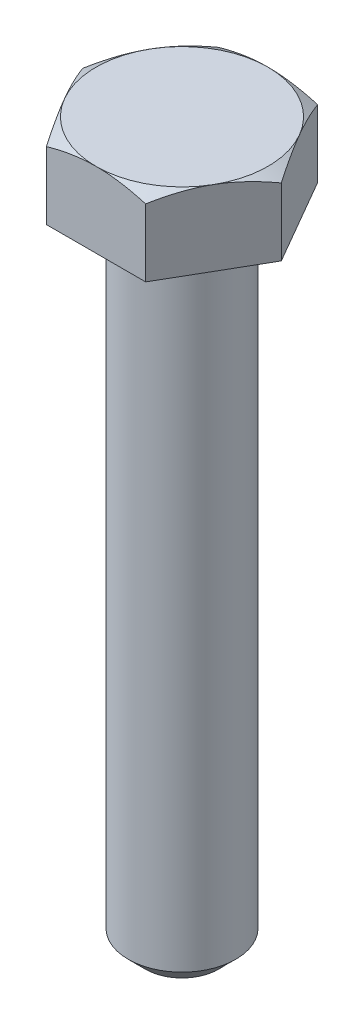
ISO-10303-21;
HEADER;
FILE_DESCRIPTION(('STEP AP214'),'2;1');
FILE_NAME('part.step','',(''),(''),'','','');
FILE_SCHEMA(('AUTOMOTIVE_DESIGN { 1 0 10303 214 1 1 1 1 }'));
ENDSEC;
DATA;
#1=APPLICATION_CONTEXT('core data for automotive mechanical design processes');
#2=APPLICATION_PROTOCOL_DEFINITION('international standard','automotive_design',2000,#1);
#3=PRODUCT_CONTEXT('',#1,'mechanical');
#4=PRODUCT('Part','Part','',(#3));
#5=PRODUCT_RELATED_PRODUCT_CATEGORY('part','',(#4));
#6=PRODUCT_DEFINITION_FORMATION('','',#4);
#7=PRODUCT_DEFINITION_CONTEXT('part definition',#1,'design');
#8=PRODUCT_DEFINITION('design','',#6,#7);
#9=PRODUCT_DEFINITION_SHAPE('','',#8);
#10=(LENGTH_UNIT() NAMED_UNIT(*) SI_UNIT(.MILLI.,.METRE.));
#11=(NAMED_UNIT(*) PLANE_ANGLE_UNIT() SI_UNIT($,.RADIAN.));
#12=(NAMED_UNIT(*) SI_UNIT($,.STERADIAN.) SOLID_ANGLE_UNIT());
#13=UNCERTAINTY_MEASURE_WITH_UNIT(LENGTH_MEASURE(1.E-05),#10,'distance_accuracy_value','');
#14=(GEOMETRIC_REPRESENTATION_CONTEXT(3) GLOBAL_UNCERTAINTY_ASSIGNED_CONTEXT((#13)) GLOBAL_UNIT_ASSIGNED_CONTEXT((#10,
#11,#12)) REPRESENTATION_CONTEXT('',''));
#15=CARTESIAN_POINT('',(0.,0.,0.));
#16=DIRECTION('',(0.,0.,1.));
#17=DIRECTION('',(1.,0.,0.));
#18=AXIS2_PLACEMENT_3D('',#15,#16,#17);
#19=CARTESIAN_POINT('',(0.,3.5,0.));
#20=DIRECTION('',(0.,-1.,0.));
#21=DIRECTION('',(1.,0.,0.));
#22=AXIS2_PLACEMENT_3D('',#19,#20,#21);
#23=PLANE('',#22);
#24=CARTESIAN_POINT('',(0.,3.50000000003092,0.));
#25=DIRECTION('',(0.,-1.,0.));
#26=DIRECTION('',(0.,0.,-1.));
#27=AXIS2_PLACEMENT_3D('',#24,#25,#26);
#28=CIRCLE('',#27,3.99999999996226);
#29=CARTESIAN_POINT('',(3.4641016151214,3.50000000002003,1.99999999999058));
#30=VERTEX_POINT('',#29);
#31=CARTESIAN_POINT('',(0.,3.50000000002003,3.99999999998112));
#32=VERTEX_POINT('',#31);
#33=EDGE_CURVE('E89',#30,#32,#28,.T.);
#34=ORIENTED_EDGE('',*,*,#33,.F.);
#35=CARTESIAN_POINT('',(0.,3.50000000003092,0.));
#36=DIRECTION('',(0.,-1.,0.));
#37=DIRECTION('',(0.,0.,-1.));
#38=AXIS2_PLACEMENT_3D('',#35,#36,#37);
#39=CIRCLE('',#38,3.99999999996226);
#40=CARTESIAN_POINT('',(3.4641016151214,3.50000000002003,-1.99999999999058));
#41=VERTEX_POINT('',#40);
#42=EDGE_CURVE('E87',#41,#30,#39,.T.);
#43=ORIENTED_EDGE('',*,*,#42,.F.);
#44=CARTESIAN_POINT('',(0.,3.50000000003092,0.));
#45=DIRECTION('',(0.,-1.,0.));
#46=DIRECTION('',(0.,0.,-1.));
#47=AXIS2_PLACEMENT_3D('',#44,#45,#46);
#48=CIRCLE('',#47,3.99999999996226);
#49=CARTESIAN_POINT('',(0.,3.50000000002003,-3.99999999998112));
#50=VERTEX_POINT('',#49);
#51=EDGE_CURVE('E20',#50,#41,#48,.T.);
#52=ORIENTED_EDGE('',*,*,#51,.F.);
#53=CARTESIAN_POINT('',(0.,3.50000000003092,0.));
#54=DIRECTION('',(0.,-1.,0.));
#55=DIRECTION('',(0.,0.,-1.));
#56=AXIS2_PLACEMENT_3D('',#53,#54,#55);
#57=CIRCLE('',#56,3.99999999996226);
#58=CARTESIAN_POINT('',(-3.4641016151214,3.50000000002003,-1.99999999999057));
#59=VERTEX_POINT('',#58);
#60=EDGE_CURVE('E104',#59,#50,#57,.T.);
#61=ORIENTED_EDGE('',*,*,#60,.F.);
#62=CARTESIAN_POINT('',(0.,3.50000000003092,0.));
#63=DIRECTION('',(0.,-1.,0.));
#64=DIRECTION('',(0.,0.,-1.));
#65=AXIS2_PLACEMENT_3D('',#62,#63,#64);
#66=CIRCLE('',#65,3.99999999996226);
#67=CARTESIAN_POINT('',(-3.4641016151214,3.50000000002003,1.99999999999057));
#68=VERTEX_POINT('',#67);
#69=EDGE_CURVE('E323',#68,#59,#66,.T.);
#70=ORIENTED_EDGE('',*,*,#69,.F.);
#71=CARTESIAN_POINT('',(0.,3.50000000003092,0.));
#72=DIRECTION('',(0.,-1.,0.));
#73=DIRECTION('',(0.,0.,-1.));
#74=AXIS2_PLACEMENT_3D('',#71,#72,#73);
#75=CIRCLE('',#74,3.99999999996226);
#76=EDGE_CURVE('E93',#32,#68,#75,.T.);
#77=ORIENTED_EDGE('',*,*,#76,.F.);
#78=EDGE_LOOP('',(#34,#43,#52,#61,#70,#77));
#79=FACE_BOUND('',#78,.T.);
#80=ADVANCED_FACE('F16',(#79),#23,.F.);
#81=CARTESIAN_POINT('',(0.,3.14059081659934,0.));
#82=DIRECTION('',(0.,-1.,0.));
#83=DIRECTION('',(0.,0.,-1.));
#84=AXIS2_PLACEMENT_3D('',#81,#82,#83);
#85=CONICAL_SURFACE('',#84,4.62251496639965,1.04719755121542);
#86=ORIENTED_EDGE('',*,*,#51,.T.);
#87=CARTESIAN_POINT('',(2.30940107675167,3.14273441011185,-4.00000000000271));
#88=CARTESIAN_POINT('',(2.4033932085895,3.19701440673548,-3.8372008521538));
#89=CARTESIAN_POINT('',(2.49813806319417,3.24674436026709,-3.67309795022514));
#90=CARTESIAN_POINT('',(2.68846293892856,3.33444223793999,-3.34344559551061));
#91=CARTESIAN_POINT('',(2.78403632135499,3.37246832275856,-3.17790764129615));
#92=CARTESIAN_POINT('',(2.92829837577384,3.41915789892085,-2.9280384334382));
#93=CARTESIAN_POINT('',(2.97656796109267,3.43300183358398,-2.84443305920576));
#94=CARTESIAN_POINT('',(3.07333821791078,3.45696597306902,-2.67682205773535));
#95=CARTESIAN_POINT('',(3.12183888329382,3.46708627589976,-2.59281644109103));
#96=CARTESIAN_POINT('',(3.21925069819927,3.48342533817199,-2.42409422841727));
#97=CARTESIAN_POINT('',(3.26816268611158,3.4896242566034,-2.33937618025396));
#98=CARTESIAN_POINT('',(3.36608285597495,3.49792016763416,-2.16977347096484));
#99=CARTESIAN_POINT('',(3.41509105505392,3.50001634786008,-2.08488878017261));
#100=CARTESIAN_POINT('',(3.46410161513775,3.50000000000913,-2.00000000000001));
#101=B_SPLINE_CURVE_WITH_KNOTS('',3,(#87,#88,#89,#90,#91,#92,#93,#94,#95,#96,#97,#98,#99,#100),
.UNSPECIFIED.,.F.,.F.,(4,2,2,2,2,2,4),(0.,0.587229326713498,1.17149154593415,1.4640059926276,
1.75651273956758,2.05048788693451,2.3445212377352),.UNSPECIFIED.);
#102=CARTESIAN_POINT('',(2.30940107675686,3.14273441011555,-4.00000000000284));
#103=VERTEX_POINT('',#102);
#104=EDGE_CURVE('E99',#103,#41,#101,.T.);
#105=ORIENTED_EDGE('',*,*,#104,.F.);
#106=CARTESIAN_POINT('',(0.,3.50000000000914,-3.99999999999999));
#107=CARTESIAN_POINT('',(0.0980211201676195,3.50001634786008,-3.99999999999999));
#108=CARTESIAN_POINT('',(0.196037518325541,3.49792016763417,-3.99999999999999));
#109=CARTESIAN_POINT('',(0.39187785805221,3.48962425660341,-3.99999999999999));
#110=CARTESIAN_POINT('',(0.489701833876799,3.48342533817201,-3.99999999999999));
#111=CARTESIAN_POINT('',(0.684525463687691,3.46708627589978,-3.99999999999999));
#112=CARTESIAN_POINT('',(0.781526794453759,3.45696597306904,-3.99999999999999));
#113=CARTESIAN_POINT('',(0.975067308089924,3.43300183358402,-3.99999999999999));
#114=CARTESIAN_POINT('',(1.07160647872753,3.41915789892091,-3.99999999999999));
#115=CARTESIAN_POINT('',(1.36013058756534,3.37246832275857,-3.99999999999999));
#116=CARTESIAN_POINT('',(1.55127735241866,3.33444223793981,-3.99999999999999));
#117=CARTESIAN_POINT('',(1.93192710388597,3.24674436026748,-3.99999999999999));
#118=CARTESIAN_POINT('',(2.12141681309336,3.19701440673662,-3.99999999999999));
#119=CARTESIAN_POINT('',(2.30940107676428,3.14273441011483,-3.99999999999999));
#120=B_SPLINE_CURVE_WITH_KNOTS('',3,(#106,#107,#108,#109,#110,#111,#112,#113,#114,#115,#116,
#117,#118,#119),.UNSPECIFIED.,.F.,.F.,(4,2,2,2,2,2,4),(0.,0.294033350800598,0.588008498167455,
0.880515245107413,1.17302969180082,1.75729191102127,2.34452123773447),.UNSPECIFIED.);
#121=EDGE_CURVE('E102',#50,#103,#120,.T.);
#122=ORIENTED_EDGE('',*,*,#121,.F.);
#123=EDGE_LOOP('',(#86,#105,#122));
#124=FACE_BOUND('',#123,.T.);
#125=ADVANCED_FACE('F97',(#124),#85,.T.);
#126=CARTESIAN_POINT('',(0.,3.14059081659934,0.));
#127=DIRECTION('',(0.,-1.,0.));
#128=DIRECTION('',(0.,0.,-1.));
#129=AXIS2_PLACEMENT_3D('',#126,#127,#128);
#130=CONICAL_SURFACE('',#129,4.62251496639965,1.04719755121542);
#131=ORIENTED_EDGE('',*,*,#60,.T.);
#132=CARTESIAN_POINT('',(-2.30940107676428,3.14273441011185,-3.99999999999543));
#133=CARTESIAN_POINT('',(-2.12141681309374,3.19701440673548,-3.9999999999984));
#134=CARTESIAN_POINT('',(-1.93192710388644,3.24674436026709,-3.99999999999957));
#135=CARTESIAN_POINT('',(-1.55127735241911,3.33444223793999,-4.0000000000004));
#136=CARTESIAN_POINT('',(-1.36013058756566,3.37246832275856,-4.00000000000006));
#137=CARTESIAN_POINT('',(-1.07160647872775,3.41915789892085,-3.99999999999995));
#138=CARTESIAN_POINT('',(-0.975067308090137,3.43300183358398,-3.99999999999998));
#139=CARTESIAN_POINT('',(-0.781526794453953,3.45696597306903,-4.));
#140=CARTESIAN_POINT('',(-0.684525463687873,3.46708627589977,-3.99999999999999));
#141=CARTESIAN_POINT('',(-0.489701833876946,3.483425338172,-3.99999999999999));
#142=CARTESIAN_POINT('',(-0.391877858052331,3.4896242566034,-3.99999999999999));
#143=CARTESIAN_POINT('',(-0.196037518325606,3.49792016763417,-3.99999999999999));
#144=CARTESIAN_POINT('',(-0.098021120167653,3.50001634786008,-3.99999999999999));
#145=CARTESIAN_POINT('',(0.,3.50000000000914,-3.99999999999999));
#146=B_SPLINE_CURVE_WITH_KNOTS('',3,(#132,#133,#134,#135,#136,#137,#138,#139,#140,#141,#142,
#143,#144,#145),.UNSPECIFIED.,.F.,.F.,(4,2,2,2,2,2,4),(0.,0.587229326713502,1.17149154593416,
1.46400599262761,1.75651273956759,2.05048788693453,2.34452123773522),.UNSPECIFIED.);
#147=CARTESIAN_POINT('',(-2.30940107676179,3.14273441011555,-3.99999999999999));
#148=VERTEX_POINT('',#147);
#149=EDGE_CURVE('E113',#148,#50,#146,.T.);
#150=ORIENTED_EDGE('',*,*,#149,.F.);
#151=CARTESIAN_POINT('',(-3.46410161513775,3.50000000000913,-2.00000000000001));
#152=CARTESIAN_POINT('',(-3.41509105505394,3.50001634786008,-2.08488878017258));
#153=CARTESIAN_POINT('',(-3.36608285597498,3.49792016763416,-2.16977347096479));
#154=CARTESIAN_POINT('',(-3.26816268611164,3.4896242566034,-2.33937618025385));
#155=CARTESIAN_POINT('',(-3.21925069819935,3.483425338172,-2.42409422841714));
#156=CARTESIAN_POINT('',(-3.1218388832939,3.46708627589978,-2.59281644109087));
#157=CARTESIAN_POINT('',(-3.07333821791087,3.45696597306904,-2.67682205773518));
#158=CARTESIAN_POINT('',(-2.97656796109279,3.43300183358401,-2.84443305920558));
#159=CARTESIAN_POINT('',(-2.92829837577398,3.41915789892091,-2.92803843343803));
#160=CARTESIAN_POINT('',(-2.78403632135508,3.37246832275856,-3.17790764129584));
#161=CARTESIAN_POINT('',(-2.68846293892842,3.33444223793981,-3.34344559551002));
#162=CARTESIAN_POINT('',(-2.49813806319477,3.24674436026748,-3.67309795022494));
#163=CARTESIAN_POINT('',(-2.40339320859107,3.19701440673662,-3.83720085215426));
#164=CARTESIAN_POINT('',(-2.30940107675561,3.14273441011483,-4.00000000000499));
#165=B_SPLINE_CURVE_WITH_KNOTS('',3,(#151,#152,#153,#154,#155,#156,#157,#158,#159,#160,#161,
#162,#163,#164),.UNSPECIFIED.,.F.,.F.,(4,2,2,2,2,2,4),(0.,0.294033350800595,0.58800849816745,
0.880515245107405,1.17302969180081,1.75729191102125,2.34452123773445),.UNSPECIFIED.);
#166=EDGE_CURVE('E169',#59,#148,#165,.T.);
#167=ORIENTED_EDGE('',*,*,#166,.F.);
#168=EDGE_LOOP('',(#131,#150,#167));
#169=FACE_BOUND('',#168,.T.);
#170=ADVANCED_FACE('F137',(#169),#130,.T.);
#171=CARTESIAN_POINT('',(0.,3.14059081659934,0.));
#172=DIRECTION('',(0.,-1.,0.));
#173=DIRECTION('',(0.,0.,-1.));
#174=AXIS2_PLACEMENT_3D('',#171,#172,#173);
#175=CONICAL_SURFACE('',#174,4.62251496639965,1.04719755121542);
#176=ORIENTED_EDGE('',*,*,#69,.T.);
#177=CARTESIAN_POINT('',(-4.61880215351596,3.14273441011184,7.2818296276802E-12));
#178=CARTESIAN_POINT('',(-4.52481002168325,3.19701440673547,-0.162799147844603));
#179=CARTESIAN_POINT('',(-4.43006516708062,3.24674436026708,-0.326902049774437));
#180=CARTESIAN_POINT('',(-4.23974029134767,3.33444223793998,-0.656554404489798));
#181=CARTESIAN_POINT('',(-4.14416690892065,3.37246832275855,-0.822092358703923));
#182=CARTESIAN_POINT('',(-3.9999048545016,3.41915789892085,-1.07196156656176));
#183=CARTESIAN_POINT('',(-3.95163526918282,3.43300183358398,-1.15556694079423));
#184=CARTESIAN_POINT('',(-3.85486501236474,3.45696597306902,-1.32317794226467));
#185=CARTESIAN_POINT('',(-3.80636434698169,3.46708627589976,-1.40718355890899));
#186=CARTESIAN_POINT('',(-3.70895253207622,3.48342533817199,-1.57590577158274));
#187=CARTESIAN_POINT('',(-3.66004054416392,3.4896242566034,-1.66062381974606));
#188=CARTESIAN_POINT('',(-3.56212037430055,3.49792016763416,-1.83022652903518));
#189=CARTESIAN_POINT('',(-3.51311217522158,3.50001634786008,-1.91511121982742));
#190=CARTESIAN_POINT('',(-3.46410161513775,3.50000000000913,-2.00000000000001));
#191=B_SPLINE_CURVE_WITH_KNOTS('',3,(#177,#178,#179,#180,#181,#182,#183,#184,#185,#186,#187,
#188,#189,#190),.UNSPECIFIED.,.F.,.F.,(4,2,2,2,2,2,4),(0.,0.587229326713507,1.17149154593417,
1.46400599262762,1.75651273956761,2.05048788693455,2.34452123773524),.UNSPECIFIED.);
#192=CARTESIAN_POINT('',(-4.61880215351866,3.14273441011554,2.84537209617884E-12));
#193=VERTEX_POINT('',#192);
#194=EDGE_CURVE('E146',#193,#59,#191,.T.);
#195=ORIENTED_EDGE('',*,*,#194,.F.);
#196=CARTESIAN_POINT('',(-3.46410161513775,3.50000000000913,2.00000000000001));
#197=CARTESIAN_POINT('',(-3.51311217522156,3.50001634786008,1.91511121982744));
#198=CARTESIAN_POINT('',(-3.56212037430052,3.49792016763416,1.83022652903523));
#199=CARTESIAN_POINT('',(-3.66004054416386,3.4896242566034,1.66062381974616));
#200=CARTESIAN_POINT('',(-3.70895253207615,3.483425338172,1.57590577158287));
#201=CARTESIAN_POINT('',(-3.8063643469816,3.46708627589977,1.40718355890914));
#202=CARTESIAN_POINT('',(-3.85486501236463,3.45696597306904,1.32317794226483));
#203=CARTESIAN_POINT('',(-3.95163526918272,3.43300183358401,1.15556694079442));
#204=CARTESIAN_POINT('',(-3.99990485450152,3.4191578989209,1.07196156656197));
#205=CARTESIAN_POINT('',(-4.14416690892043,3.37246832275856,0.822092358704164));
#206=CARTESIAN_POINT('',(-4.23974029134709,3.3344422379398,0.656554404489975));
#207=CARTESIAN_POINT('',(-4.43006516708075,3.24674436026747,0.326902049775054));
#208=CARTESIAN_POINT('',(-4.52481002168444,3.19701440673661,0.162799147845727));
#209=CARTESIAN_POINT('',(-4.6188021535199,3.14273441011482,-5.00231021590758E-12));
#210=B_SPLINE_CURVE_WITH_KNOTS('',3,(#196,#197,#198,#199,#200,#201,#202,#203,#204,#205,#206,
#207,#208,#209),.UNSPECIFIED.,.F.,.F.,(4,2,2,2,2,2,4),(0.,0.294033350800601,0.58800849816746,
0.880515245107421,1.17302969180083,1.75729191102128,2.34452123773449),.UNSPECIFIED.);
#211=EDGE_CURVE('E183',#68,#193,#210,.T.);
#212=ORIENTED_EDGE('',*,*,#211,.F.);
#213=EDGE_LOOP('',(#176,#195,#212));
#214=FACE_BOUND('',#213,.T.);
#215=ADVANCED_FACE('F191',(#214),#175,.T.);
#216=CARTESIAN_POINT('',(0.,3.14059081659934,0.));
#217=DIRECTION('',(0.,-1.,0.));
#218=DIRECTION('',(0.,0.,-1.));
#219=AXIS2_PLACEMENT_3D('',#216,#217,#218);
#220=CONICAL_SURFACE('',#219,4.62251496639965,1.04719755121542);
#221=ORIENTED_EDGE('',*,*,#76,.T.);
#222=CARTESIAN_POINT('',(-2.30940107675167,3.14273441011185,4.00000000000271));
#223=CARTESIAN_POINT('',(-2.40339320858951,3.19701440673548,3.8372008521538));
#224=CARTESIAN_POINT('',(-2.49813806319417,3.24674436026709,3.67309795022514));
#225=CARTESIAN_POINT('',(-2.68846293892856,3.33444223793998,3.34344559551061));
#226=CARTESIAN_POINT('',(-2.78403632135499,3.37246832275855,3.17790764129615));
#227=CARTESIAN_POINT('',(-2.92829837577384,3.41915789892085,2.9280384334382));
#228=CARTESIAN_POINT('',(-2.97656796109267,3.43300183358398,2.84443305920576));
#229=CARTESIAN_POINT('',(-3.07333821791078,3.45696597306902,2.67682205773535));
#230=CARTESIAN_POINT('',(-3.12183888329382,3.46708627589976,2.59281644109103));
#231=CARTESIAN_POINT('',(-3.21925069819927,3.48342533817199,2.42409422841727));
#232=CARTESIAN_POINT('',(-3.26816268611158,3.4896242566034,2.33937618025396));
#233=CARTESIAN_POINT('',(-3.36608285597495,3.49792016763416,2.16977347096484));
#234=CARTESIAN_POINT('',(-3.41509105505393,3.50001634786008,2.08488878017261));
#235=CARTESIAN_POINT('',(-3.46410161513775,3.50000000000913,2.00000000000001));
#236=B_SPLINE_CURVE_WITH_KNOTS('',3,(#222,#223,#224,#225,#226,#227,#228,#229,#230,#231,#232,
#233,#234,#235),.UNSPECIFIED.,.F.,.F.,(4,2,2,2,2,2,4),(0.,0.587229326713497,1.17149154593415,
1.4640059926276,1.75651273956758,2.05048788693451,2.3445212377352),.UNSPECIFIED.);
#237=CARTESIAN_POINT('',(-2.30940107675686,3.14273441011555,4.00000000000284));
#238=VERTEX_POINT('',#237);
#239=EDGE_CURVE('E176',#238,#68,#236,.T.);
#240=ORIENTED_EDGE('',*,*,#239,.F.);
#241=CARTESIAN_POINT('',(0.,3.50000000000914,3.99999999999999));
#242=CARTESIAN_POINT('',(-0.0980211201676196,3.50001634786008,3.99999999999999));
#243=CARTESIAN_POINT('',(-0.196037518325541,3.49792016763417,3.99999999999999));
#244=CARTESIAN_POINT('',(-0.39187785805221,3.48962425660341,3.99999999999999));
#245=CARTESIAN_POINT('',(-0.489701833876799,3.48342533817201,3.99999999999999));
#246=CARTESIAN_POINT('',(-0.684525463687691,3.46708627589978,3.99999999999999));
#247=CARTESIAN_POINT('',(-0.78152679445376,3.45696597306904,3.99999999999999));
#248=CARTESIAN_POINT('',(-0.975067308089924,3.43300183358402,3.99999999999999));
#249=CARTESIAN_POINT('',(-1.07160647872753,3.41915789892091,3.99999999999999));
#250=CARTESIAN_POINT('',(-1.36013058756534,3.37246832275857,3.99999999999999));
#251=CARTESIAN_POINT('',(-1.55127735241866,3.33444223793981,3.99999999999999));
#252=CARTESIAN_POINT('',(-1.93192710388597,3.24674436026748,3.99999999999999));
#253=CARTESIAN_POINT('',(-2.12141681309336,3.19701440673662,3.99999999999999));
#254=CARTESIAN_POINT('',(-2.30940107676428,3.14273441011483,3.99999999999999));
#255=B_SPLINE_CURVE_WITH_KNOTS('',3,(#241,#242,#243,#244,#245,#246,#247,#248,#249,#250,#251,
#252,#253,#254),.UNSPECIFIED.,.F.,.F.,(4,2,2,2,2,2,4),(0.,0.294033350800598,0.588008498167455,
0.880515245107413,1.17302969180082,1.75729191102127,2.34452123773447),.UNSPECIFIED.);
#256=EDGE_CURVE('E198',#32,#238,#255,.T.);
#257=ORIENTED_EDGE('',*,*,#256,.F.);
#258=EDGE_LOOP('',(#221,#240,#257));
#259=FACE_BOUND('',#258,.T.);
#260=ADVANCED_FACE('F188',(#259),#220,.T.);
#261=CARTESIAN_POINT('',(0.,3.14059081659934,0.));
#262=DIRECTION('',(0.,-1.,0.));
#263=DIRECTION('',(0.,0.,-1.));
#264=AXIS2_PLACEMENT_3D('',#261,#262,#263);
#265=CONICAL_SURFACE('',#264,4.62251496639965,1.04719755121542);
#266=ORIENTED_EDGE('',*,*,#42,.T.);
#267=CARTESIAN_POINT('',(4.61880215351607,3.1427344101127,-5.88236889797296E-12));
#268=CARTESIAN_POINT('',(4.52481002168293,3.19701440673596,0.16279914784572));
#269=CARTESIAN_POINT('',(4.43006516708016,3.24674436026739,0.326902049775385));
#270=CARTESIAN_POINT('',(4.23974029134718,3.33444223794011,0.656554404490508));
#271=CARTESIAN_POINT('',(4.14416690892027,3.37246832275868,0.822092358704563));
#272=CARTESIAN_POINT('',(3.99990485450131,3.41915789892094,1.07196156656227));
#273=CARTESIAN_POINT('',(3.95163526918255,3.43300183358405,1.1555669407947));
#274=CARTESIAN_POINT('',(3.85486501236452,3.45696597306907,1.32317794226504));
#275=CARTESIAN_POINT('',(3.8063643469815,3.4670862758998,1.40718355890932));
#276=CARTESIAN_POINT('',(3.70895253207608,3.48342533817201,1.57590577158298));
#277=CARTESIAN_POINT('',(3.6600405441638,3.48962425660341,1.66062381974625));
#278=CARTESIAN_POINT('',(3.5621203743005,3.49792016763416,1.83022652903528));
#279=CARTESIAN_POINT('',(3.51311217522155,3.50001634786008,1.91511121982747));
#280=CARTESIAN_POINT('',(3.46410161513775,3.50000000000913,2.00000000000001));
#281=B_SPLINE_CURVE_WITH_KNOTS('',3,(#267,#268,#269,#270,#271,#272,#273,#274,#275,#276,#277,
#278,#279,#280),.UNSPECIFIED.,.F.,.F.,(4,2,2,2,2,2,4),(0.,0.587229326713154,1.17149154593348,
1.46400599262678,1.75651273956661,2.05048788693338,2.34452123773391),.UNSPECIFIED.);
#282=CARTESIAN_POINT('',(4.61880215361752,3.14273441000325,2.28554564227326E-12));
#283=VERTEX_POINT('',#282);
#284=EDGE_CURVE('E109',#283,#30,#281,.T.);
#285=ORIENTED_EDGE('',*,*,#284,.F.);
#286=CARTESIAN_POINT('',(3.46410161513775,3.50000000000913,-2.00000000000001));
#287=CARTESIAN_POINT('',(3.51311217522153,3.50001634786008,-1.91511121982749));
#288=CARTESIAN_POINT('',(3.56212037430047,3.49792016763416,-1.83022652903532));
#289=CARTESIAN_POINT('',(3.66004054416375,3.48962425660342,-1.66062381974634));
#290=CARTESIAN_POINT('',(3.70895253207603,3.48342533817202,-1.57590577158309));
#291=CARTESIAN_POINT('',(3.80636434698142,3.46708627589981,-1.40718355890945));
#292=CARTESIAN_POINT('',(3.85486501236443,3.45696597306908,-1.32317794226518));
#293=CARTESIAN_POINT('',(3.95163526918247,3.43300183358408,-1.15556694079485));
#294=CARTESIAN_POINT('',(3.99990485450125,3.41915789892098,-1.07196156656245));
#295=CARTESIAN_POINT('',(4.14416690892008,3.37246832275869,-0.82209235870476));
#296=CARTESIAN_POINT('',(4.2397402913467,3.33444223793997,-0.656554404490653));
#297=CARTESIAN_POINT('',(4.43006516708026,3.24674436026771,-0.326902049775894));
#298=CARTESIAN_POINT('',(4.52481002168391,3.1970144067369,-0.162799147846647));
#299=CARTESIAN_POINT('',(4.61880215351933,3.14273441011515,4.0037334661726E-12));
#300=B_SPLINE_CURVE_WITH_KNOTS('',3,(#286,#287,#288,#289,#290,#291,#292,#293,#294,#295,#296,
#297,#298,#299),.UNSPECIFIED.,.F.,.F.,(4,2,2,2,2,2,4),(0.,0.294033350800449,0.588008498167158,
0.880515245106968,1.17302969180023,1.75729191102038,2.34452123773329),.UNSPECIFIED.);
#301=EDGE_CURVE('E106',#41,#283,#300,.T.);
#302=ORIENTED_EDGE('',*,*,#301,.F.);
#303=EDGE_LOOP('',(#266,#285,#302));
#304=FACE_BOUND('',#303,.T.);
#305=ADVANCED_FACE('F107',(#304),#265,.T.);
#306=CARTESIAN_POINT('',(0.,3.14059081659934,0.));
#307=DIRECTION('',(0.,-1.,0.));
#308=DIRECTION('',(0.,0.,-1.));
#309=AXIS2_PLACEMENT_3D('',#306,#307,#308);
#310=CONICAL_SURFACE('',#309,4.62251496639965,1.04719755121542);
#311=ORIENTED_EDGE('',*,*,#33,.T.);
#312=CARTESIAN_POINT('',(2.30940107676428,3.14273441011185,3.99999999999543));
#313=CARTESIAN_POINT('',(2.12141681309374,3.19701440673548,3.9999999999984));
#314=CARTESIAN_POINT('',(1.93192710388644,3.24674436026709,3.99999999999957));
#315=CARTESIAN_POINT('',(1.5512773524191,3.33444223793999,4.0000000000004));
#316=CARTESIAN_POINT('',(1.36013058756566,3.37246832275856,4.00000000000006));
#317=CARTESIAN_POINT('',(1.07160647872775,3.41915789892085,3.99999999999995));
#318=CARTESIAN_POINT('',(0.975067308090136,3.43300183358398,3.99999999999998));
#319=CARTESIAN_POINT('',(0.781526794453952,3.45696597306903,4.));
#320=CARTESIAN_POINT('',(0.684525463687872,3.46708627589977,3.99999999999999));
#321=CARTESIAN_POINT('',(0.489701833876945,3.483425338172,3.99999999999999));
#322=CARTESIAN_POINT('',(0.39187785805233,3.4896242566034,3.99999999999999));
#323=CARTESIAN_POINT('',(0.196037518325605,3.49792016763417,3.99999999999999));
#324=CARTESIAN_POINT('',(0.0980211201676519,3.50001634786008,3.99999999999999));
#325=CARTESIAN_POINT('',(0.,3.50000000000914,3.99999999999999));
#326=B_SPLINE_CURVE_WITH_KNOTS('',3,(#312,#313,#314,#315,#316,#317,#318,#319,#320,#321,#322,
#323,#324,#325),.UNSPECIFIED.,.F.,.F.,(4,2,2,2,2,2,4),(0.,0.587229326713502,1.17149154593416,
1.46400599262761,1.7565127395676,2.05048788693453,2.34452123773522),.UNSPECIFIED.);
#327=CARTESIAN_POINT('',(2.30940107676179,3.14273441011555,3.99999999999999));
#328=VERTEX_POINT('',#327);
#329=EDGE_CURVE('E205',#328,#32,#326,.T.);
#330=ORIENTED_EDGE('',*,*,#329,.F.);
#331=CARTESIAN_POINT('',(3.46410161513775,3.50000000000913,2.00000000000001));
#332=CARTESIAN_POINT('',(3.41509105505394,3.50001634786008,2.08488878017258));
#333=CARTESIAN_POINT('',(3.36608285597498,3.49792016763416,2.16977347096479));
#334=CARTESIAN_POINT('',(3.26816268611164,3.4896242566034,2.33937618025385));
#335=CARTESIAN_POINT('',(3.21925069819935,3.483425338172,2.42409422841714));
#336=CARTESIAN_POINT('',(3.1218388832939,3.46708627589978,2.59281644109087));
#337=CARTESIAN_POINT('',(3.07333821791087,3.45696597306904,2.67682205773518));
#338=CARTESIAN_POINT('',(2.97656796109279,3.43300183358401,2.84443305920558));
#339=CARTESIAN_POINT('',(2.92829837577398,3.41915789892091,2.92803843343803));
#340=CARTESIAN_POINT('',(2.78403632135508,3.37246832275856,3.17790764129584));
#341=CARTESIAN_POINT('',(2.68846293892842,3.33444223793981,3.34344559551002));
#342=CARTESIAN_POINT('',(2.49813806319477,3.24674436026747,3.67309795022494));
#343=CARTESIAN_POINT('',(2.40339320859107,3.19701440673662,3.83720085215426));
#344=CARTESIAN_POINT('',(2.30940107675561,3.14273441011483,4.00000000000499));
#345=B_SPLINE_CURVE_WITH_KNOTS('',3,(#331,#332,#333,#334,#335,#336,#337,#338,#339,#340,#341,
#342,#343,#344),.UNSPECIFIED.,.F.,.F.,(4,2,2,2,2,2,4),(0.,0.294033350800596,0.58800849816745,
0.880515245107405,1.17302969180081,1.75729191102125,2.34452123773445),.UNSPECIFIED.);
#346=EDGE_CURVE('E225',#30,#328,#345,.T.);
#347=ORIENTED_EDGE('',*,*,#346,.F.);
#348=EDGE_LOOP('',(#311,#330,#347));
#349=FACE_BOUND('',#348,.T.);
#350=ADVANCED_FACE('F233',(#349),#310,.T.);
#351=CARTESIAN_POINT('',(0.,-30.,0.));
#352=DIRECTION('',(0.,1.,0.));
#353=DIRECTION('',(0.,0.,1.));
#354=AXIS2_PLACEMENT_3D('',#351,#352,#353);
#355=PLANE('',#354);
#356=CARTESIAN_POINT('',(0.,-30.0000000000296,0.));
#357=DIRECTION('',(0.,1.,0.));
#358=DIRECTION('',(0.,0.,1.));
#359=AXIS2_PLACEMENT_3D('',#356,#357,#358);
#360=CIRCLE('',#359,1.70000000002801);
#361=CARTESIAN_POINT('',(0.,-30.0000000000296,1.70000000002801));
#362=VERTEX_POINT('',#361);
#363=EDGE_CURVE('E232',#362,#362,#360,.T.);
#364=ORIENTED_EDGE('',*,*,#363,.F.);
#365=EDGE_LOOP('',(#364));
#366=FACE_BOUND('',#365,.T.);
#367=ADVANCED_FACE('F236',(#366),#355,.F.);
#368=CARTESIAN_POINT('',(2.3094010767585,19.66,-3.99999999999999));
#369=DIRECTION('',(0.866025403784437,0.,-0.500000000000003));
#370=DIRECTION('',(-0.500000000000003,0.,-0.866025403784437));
#371=AXIS2_PLACEMENT_3D('',#368,#369,#370);
#372=PLANE('',#371);
#373=DIRECTION('',(-0.500000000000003,0.,-0.866025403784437));
#374=VECTOR('',#373,1.);
#375=CARTESIAN_POINT('',(4.61880215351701,0.,0.));
#376=LINE('',#375,#374);
#377=CARTESIAN_POINT('',(4.61880215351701,0.,0.));
#378=VERTEX_POINT('',#377);
#379=CARTESIAN_POINT('',(2.3094010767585,0.,-3.99999999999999));
#380=VERTEX_POINT('',#379);
#381=EDGE_CURVE('E268',#378,#380,#376,.T.);
#382=ORIENTED_EDGE('',*,*,#381,.T.);
#383=DIRECTION('',(0.,1.,0.));
#384=VECTOR('',#383,1.);
#385=CARTESIAN_POINT('',(2.3094010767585,19.66,-3.99999999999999));
#386=LINE('',#385,#384);
#387=EDGE_CURVE('E117',#103,#380,#386,.F.);
#388=ORIENTED_EDGE('',*,*,#387,.F.);
#389=ORIENTED_EDGE('',*,*,#104,.T.);
#390=ORIENTED_EDGE('',*,*,#301,.T.);
#391=DIRECTION('',(0.,1.,0.));
#392=VECTOR('',#391,1.);
#393=CARTESIAN_POINT('',(4.61880215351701,19.66,0.));
#394=LINE('',#393,#392);
#395=EDGE_CURVE('E312',#378,#283,#394,.T.);
#396=ORIENTED_EDGE('',*,*,#395,.F.);
#397=EDGE_LOOP('',(#382,#388,#389,#390,#396));
#398=FACE_BOUND('',#397,.T.);
#399=ADVANCED_FACE('F115',(#398),#372,.T.);
#400=CARTESIAN_POINT('',(-2.3094010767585,19.66,-3.99999999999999));
#401=DIRECTION('',(0.,0.,-1.));
#402=DIRECTION('',(-1.,0.,0.));
#403=AXIS2_PLACEMENT_3D('',#400,#401,#402);
#404=PLANE('',#403);
#405=DIRECTION('',(-1.,0.,0.));
#406=VECTOR('',#405,1.);
#407=CARTESIAN_POINT('',(0.,0.,-3.99999999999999));
#408=LINE('',#407,#406);
#409=CARTESIAN_POINT('',(-2.3094010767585,0.,-3.99999999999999));
#410=VERTEX_POINT('',#409);
#411=EDGE_CURVE('E270',#380,#410,#408,.T.);
#412=ORIENTED_EDGE('',*,*,#411,.T.);
#413=DIRECTION('',(0.,1.,0.));
#414=VECTOR('',#413,1.);
#415=CARTESIAN_POINT('',(-2.3094010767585,19.66,-3.99999999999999));
#416=LINE('',#415,#414);
#417=EDGE_CURVE('E175',#148,#410,#416,.F.);
#418=ORIENTED_EDGE('',*,*,#417,.F.);
#419=ORIENTED_EDGE('',*,*,#149,.T.);
#420=ORIENTED_EDGE('',*,*,#121,.T.);
#421=ORIENTED_EDGE('',*,*,#387,.T.);
#422=EDGE_LOOP('',(#412,#418,#419,#420,#421));
#423=FACE_BOUND('',#422,.T.);
#424=ADVANCED_FACE('F155',(#423),#404,.T.);
#425=CARTESIAN_POINT('',(-2.3094010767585,19.66,-3.99999999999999));
#426=DIRECTION('',(-0.866025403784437,0.,-0.500000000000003));
#427=DIRECTION('',(-0.500000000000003,0.,0.866025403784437));
#428=AXIS2_PLACEMENT_3D('',#425,#426,#427);
#429=PLANE('',#428);
#430=DIRECTION('',(-0.500000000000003,0.,0.866025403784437));
#431=VECTOR('',#430,1.);
#432=CARTESIAN_POINT('',(-2.3094010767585,0.,-3.99999999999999));
#433=LINE('',#432,#431);
#434=CARTESIAN_POINT('',(-4.61880215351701,0.,0.));
#435=VERTEX_POINT('',#434);
#436=EDGE_CURVE('E278',#410,#435,#433,.T.);
#437=ORIENTED_EDGE('',*,*,#436,.T.);
#438=DIRECTION('',(0.,1.,0.));
#439=VECTOR('',#438,1.);
#440=CARTESIAN_POINT('',(-4.61880215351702,19.66,0.));
#441=LINE('',#440,#439);
#442=EDGE_CURVE('E302',#193,#435,#441,.F.);
#443=ORIENTED_EDGE('',*,*,#442,.F.);
#444=ORIENTED_EDGE('',*,*,#194,.T.);
#445=ORIENTED_EDGE('',*,*,#166,.T.);
#446=ORIENTED_EDGE('',*,*,#417,.T.);
#447=EDGE_LOOP('',(#437,#443,#444,#445,#446));
#448=FACE_BOUND('',#447,.T.);
#449=ADVANCED_FACE('F158',(#448),#429,.T.);
#450=CARTESIAN_POINT('',(-2.3094010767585,19.66,3.99999999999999));
#451=DIRECTION('',(-0.866025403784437,0.,0.500000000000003));
#452=DIRECTION('',(0.500000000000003,0.,0.866025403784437));
#453=AXIS2_PLACEMENT_3D('',#450,#451,#452);
#454=PLANE('',#453);
#455=DIRECTION('',(0.500000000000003,0.,0.866025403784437));
#456=VECTOR('',#455,1.);
#457=CARTESIAN_POINT('',(-4.61880215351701,0.,0.));
#458=LINE('',#457,#456);
#459=CARTESIAN_POINT('',(-2.3094010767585,0.,3.99999999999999));
#460=VERTEX_POINT('',#459);
#461=EDGE_CURVE('E274',#435,#460,#458,.T.);
#462=ORIENTED_EDGE('',*,*,#461,.T.);
#463=DIRECTION('',(0.,1.,0.));
#464=VECTOR('',#463,1.);
#465=CARTESIAN_POINT('',(-2.3094010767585,19.66,3.99999999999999));
#466=LINE('',#465,#464);
#467=EDGE_CURVE('E204',#238,#460,#466,.F.);
#468=ORIENTED_EDGE('',*,*,#467,.F.);
#469=ORIENTED_EDGE('',*,*,#239,.T.);
#470=ORIENTED_EDGE('',*,*,#211,.T.);
#471=ORIENTED_EDGE('',*,*,#442,.T.);
#472=EDGE_LOOP('',(#462,#468,#469,#470,#471));
#473=FACE_BOUND('',#472,.T.);
#474=ADVANCED_FACE('F164',(#473),#454,.T.);
#475=CARTESIAN_POINT('',(-2.3094010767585,19.66,3.99999999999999));
#476=DIRECTION('',(0.,0.,1.));
#477=DIRECTION('',(1.,0.,0.));
#478=AXIS2_PLACEMENT_3D('',#475,#476,#477);
#479=PLANE('',#478);
#480=DIRECTION('',(-1.,0.,0.));
#481=VECTOR('',#480,1.);
#482=CARTESIAN_POINT('',(0.,0.,3.99999999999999));
#483=LINE('',#482,#481);
#484=CARTESIAN_POINT('',(2.3094010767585,0.,3.99999999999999));
#485=VERTEX_POINT('',#484);
#486=EDGE_CURVE('E35',#460,#485,#483,.F.);
#487=ORIENTED_EDGE('',*,*,#486,.T.);
#488=DIRECTION('',(0.,1.,0.));
#489=VECTOR('',#488,1.);
#490=CARTESIAN_POINT('',(2.3094010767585,19.66,3.99999999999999));
#491=LINE('',#490,#489);
#492=EDGE_CURVE('E231',#328,#485,#491,.F.);
#493=ORIENTED_EDGE('',*,*,#492,.F.);
#494=ORIENTED_EDGE('',*,*,#329,.T.);
#495=ORIENTED_EDGE('',*,*,#256,.T.);
#496=ORIENTED_EDGE('',*,*,#467,.T.);
#497=EDGE_LOOP('',(#487,#493,#494,#495,#496));
#498=FACE_BOUND('',#497,.T.);
#499=ADVANCED_FACE('F214',(#498),#479,.T.);
#500=CARTESIAN_POINT('',(2.3094010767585,19.66,3.99999999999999));
#501=DIRECTION('',(0.866025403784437,0.,0.500000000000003));
#502=DIRECTION('',(0.500000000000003,0.,-0.866025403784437));
#503=AXIS2_PLACEMENT_3D('',#500,#501,#502);
#504=PLANE('',#503);
#505=DIRECTION('',(0.500000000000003,0.,-0.866025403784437));
#506=VECTOR('',#505,1.);
#507=CARTESIAN_POINT('',(2.3094010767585,0.,3.99999999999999));
#508=LINE('',#507,#506);
#509=EDGE_CURVE('E258',#485,#378,#508,.T.);
#510=ORIENTED_EDGE('',*,*,#509,.T.);
#511=ORIENTED_EDGE('',*,*,#395,.T.);
#512=ORIENTED_EDGE('',*,*,#284,.T.);
#513=ORIENTED_EDGE('',*,*,#346,.T.);
#514=ORIENTED_EDGE('',*,*,#492,.T.);
#515=EDGE_LOOP('',(#510,#511,#512,#513,#514));
#516=FACE_BOUND('',#515,.T.);
#517=ADVANCED_FACE('F217',(#516),#504,.T.);
#518=CARTESIAN_POINT('',(0.,-29.2000000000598,0.));
#519=DIRECTION('',(0.,1.,0.));
#520=DIRECTION('',(0.,0.,1.));
#521=AXIS2_PLACEMENT_3D('',#518,#519,#520);
#522=CONICAL_SURFACE('',#521,2.49999999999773,0.785398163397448);
#523=CARTESIAN_POINT('',(0.,-29.2,0.));
#524=DIRECTION('',(0.,1.,0.));
#525=DIRECTION('',(0.,0.,1.));
#526=AXIS2_PLACEMENT_3D('',#523,#524,#525);
#527=CIRCLE('',#526,2.5);
#528=CARTESIAN_POINT('',(0.,-29.2,2.5));
#529=VERTEX_POINT('',#528);
#530=EDGE_CURVE('E26',#529,#529,#527,.T.);
#531=ORIENTED_EDGE('',*,*,#530,.F.);
#532=EDGE_LOOP('',(#531));
#533=FACE_BOUND('',#532,.T.);
#534=ORIENTED_EDGE('',*,*,#363,.T.);
#535=EDGE_LOOP('',(#534));
#536=FACE_BOUND('',#535,.T.);
#537=ADVANCED_FACE('F222',(#533,#536),#522,.T.);
#538=CARTESIAN_POINT('',(0.,0.,0.));
#539=DIRECTION('',(0.,1.,0.));
#540=DIRECTION('',(-1.,0.,0.));
#541=AXIS2_PLACEMENT_3D('',#538,#539,#540);
#542=PLANE('',#541);
#543=ORIENTED_EDGE('',*,*,#486,.F.);
#544=ORIENTED_EDGE('',*,*,#461,.F.);
#545=ORIENTED_EDGE('',*,*,#436,.F.);
#546=ORIENTED_EDGE('',*,*,#411,.F.);
#547=ORIENTED_EDGE('',*,*,#381,.F.);
#548=ORIENTED_EDGE('',*,*,#509,.F.);
#549=EDGE_LOOP('',(#543,#544,#545,#546,#547,#548));
#550=FACE_BOUND('',#549,.T.);
#551=CARTESIAN_POINT('',(0.,0.,0.));
#552=DIRECTION('',(0.,1.,0.));
#553=DIRECTION('',(0.,0.,1.));
#554=AXIS2_PLACEMENT_3D('',#551,#552,#553);
#555=CIRCLE('',#554,2.5);
#556=CARTESIAN_POINT('',(0.,0.,2.5));
#557=VERTEX_POINT('',#556);
#558=EDGE_CURVE('E10',#557,#557,#555,.F.);
#559=ORIENTED_EDGE('',*,*,#558,.F.);
#560=EDGE_LOOP('',(#559));
#561=FACE_BOUND('',#560,.T.);
#562=ADVANCED_FACE('F247',(#550,#561),#542,.F.);
#563=CARTESIAN_POINT('',(0.,-30.,0.));
#564=DIRECTION('',(0.,1.,0.));
#565=DIRECTION('',(0.,0.,1.));
#566=AXIS2_PLACEMENT_3D('',#563,#564,#565);
#567=CYLINDRICAL_SURFACE('',#566,2.5);
#568=ORIENTED_EDGE('',*,*,#558,.T.);
#569=EDGE_LOOP('',(#568));
#570=FACE_BOUND('',#569,.T.);
#571=ORIENTED_EDGE('',*,*,#530,.T.);
#572=EDGE_LOOP('',(#571));
#573=FACE_BOUND('',#572,.T.);
#574=ADVANCED_FACE('F18',(#570,#573),#567,.T.);
#575=CLOSED_SHELL('',(#80,#125,#170,#215,#260,#305,#350,#367,#399,#424,#449,#474,#499,#517,#537,
#562,#574));
#576=MANIFOLD_SOLID_BREP('B1',#575);
#577=ADVANCED_BREP_SHAPE_REPRESENTATION('',(#18,#576),#14);
#578=SHAPE_DEFINITION_REPRESENTATION(#9,#577);
ENDSEC;
END-ISO-10303-21;
